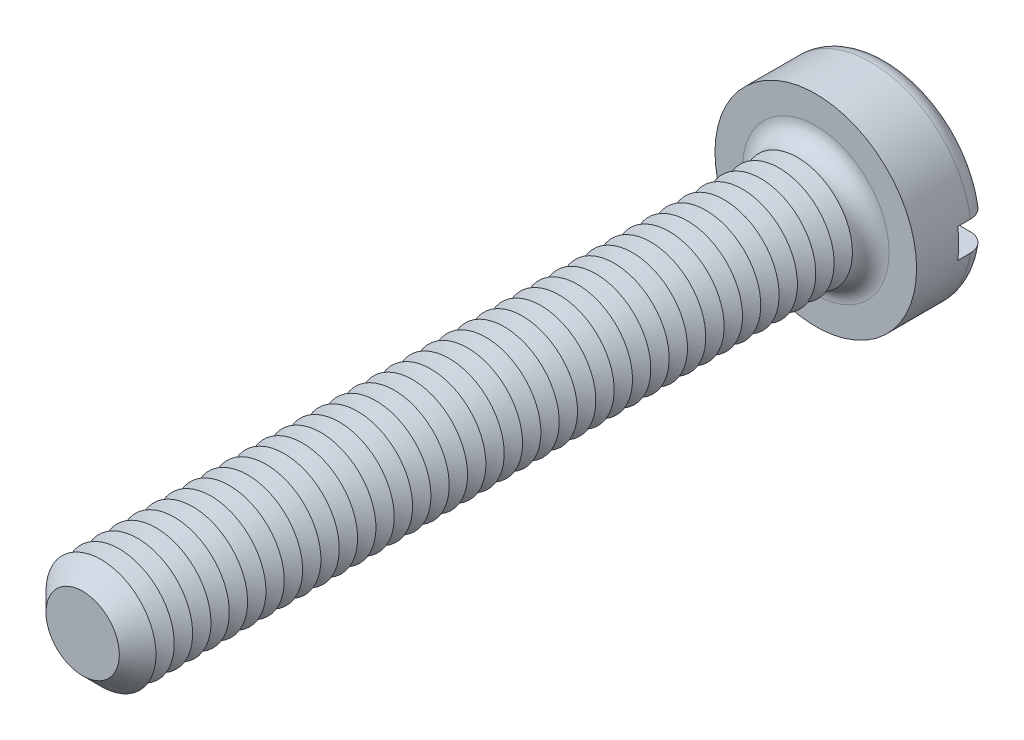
from build123d import *

# Parameters (mm, degrees)
SKETCH3_R           = 2.75
BOSS_EXTRUDE2_DEPTH = 2
SKETCH4_R           = 1.5
BOSS_EXTRUDE3_DEPTH = 20
FILLET1_R           = 0.5
CHAMFER1_SIZE       = 0.5
LPATTERN1_COUNT     = 38
LPATTERN1_PITCH     = 0.5
SKETCH8_W           = 5.5
SKETCH8_H           = 0.8
CUT_EXTRUDE1_DEPTH  = 0.85


with BuildPart() as part:
    # Sketch3 → Boss-Extrude2 (new body)
    with BuildSketch(Plane.XY):
        Circle(SKETCH3_R)
    extrude(amount=-BOSS_EXTRUDE2_DEPTH)

    # Sketch4 → Boss-Extrude3 (add)
    with BuildSketch(Plane.XY):
        Circle(SKETCH4_R)
    extrude(amount=BOSS_EXTRUDE3_DEPTH)

    # Fillet1
    fillet1_edges = [part.edges().sort_by_distance(p)[0] for p in [
        (-2.75, 0, -2),
        (-1.5, 0, 0),
    ]]
    fillet(fillet1_edges, radius=FILLET1_R)

    # Chamfer1
    chamfer1_edges = [part.edges().sort_by_distance(p)[0] for p in [
        (-1.5, 0, 20),
    ]]
    chamfer(chamfer1_edges, length=CHAMFER1_SIZE)

    # Sketch6 → Cut-Revolve1 (revolve, cut)
    with BuildSketch(Plane(origin=(0, 0, 0), x_dir=(0, 0, -1), z_dir=(1, 0, 0)), mode=Mode.PRIVATE) as cut_revolve1_sk:
        Polygon((-0.5, 1.5), (-0.75, 1.066987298), (-1, 1.5), align=None)
    cut_revolve1 = revolve(cut_revolve1_sk.sketch.rotate(Axis((0, 0, -1.694361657), (0, 0, 1)), 90), axis=Axis((0, 0, -1.694361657), (0, 0, 1)), mode=Mode.SUBTRACT)

    # LPattern1: Cut-Revolve1 ×38
    with Locations(*[(0, 0, i * LPATTERN1_PITCH) for i in range(1, LPATTERN1_COUNT)]):
        add(cut_revolve1, mode=Mode.SUBTRACT)

    # Sketch8 → Cut-Extrude1 (cut)
    with BuildSketch(Plane(origin=(0, 0, -2), x_dir=(-1, 0, 0), z_dir=(0, 0, -1))):
        Rectangle(SKETCH8_W, SKETCH8_H)
    extrude(amount=-CUT_EXTRUDE1_DEPTH, mode=Mode.SUBTRACT)


solid = part.part
